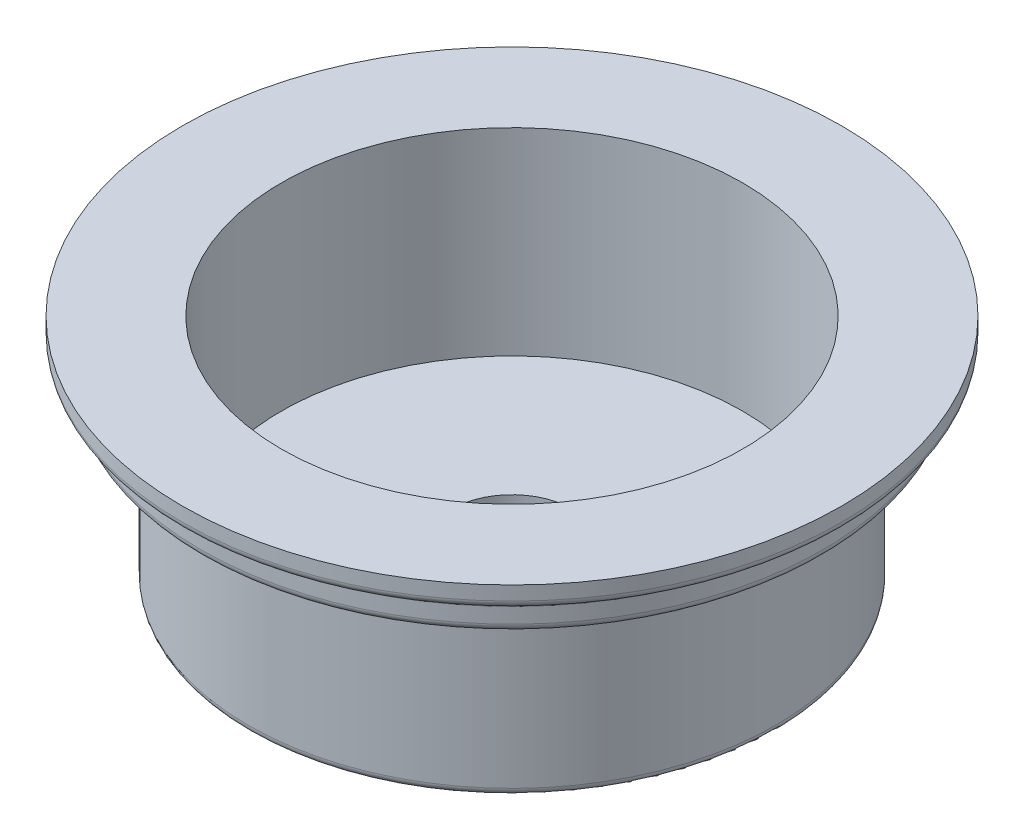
from build123d import *

# Parameters (mm, degrees)
FILLET1_R       = 1.524
SKETCH21_R      = 13.1445
NPT_DEPTH       = 14.05382
NPT_DRAFT       = -1.783333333
SKETCH31_R      = 11.6967
TAP_DRILL_DEPTH = 38.1


with BuildPart() as part:
    # Sketch1 → Base-Revolve (revolve)
    with BuildSketch(Plane.XY, mode=Mode.PRIVATE) as base_revolve_sk:
        Polygon((0, -38.1), (44.45, -38.1), (44.45, -3.16865), (44.45, 0), (54.7751, 0), (63.5, 0), (63.5, -3.7592), (59.9186, -5.062722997), (59.9186, -10.142722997), (50.8, -13.461621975), (50.8, -44.45), (44.45, -44.45), (19.05, -57.15), (0, -57.15), align=None)
    revolve(base_revolve_sk.sketch.rotate(Axis((0, 0, 0), (0, -1, 0)), 90), axis=Axis((0, 0, 0), (0, -1, 0)))

    # Fillet1
    fillet1_edges = [part.edges().sort_by_distance(p)[0] for p in [
        (0, -3.7592, -63.5),
        (0, -5.062722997, -59.9186),
        (0, -10.142722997, -59.9186),
        (0, -13.461621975, -50.8),
        (0, -44.45, -50.8),
        (0, -44.45, -44.45),
        (0, -57.15, -19.05),
    ]]
    fillet(fillet1_edges, radius=FILLET1_R)


with BuildPart() as npt_tool:
    # Sketch21 → NPT (with draft: the straight prism first)
    with BuildSketch(Plane(origin=(2.617351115, -57.15, 3.362535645), x_dir=(1, 0, 0), z_dir=(0, -1, 0))):
        with Locations((-2.617351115, -3.362535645)):
            Circle(SKETCH21_R)
    extrude(amount=-NPT_DEPTH)
    # NPT: the draft: its side faces are tilted about the plane it starts from
    npt_sides = [npt_tool.faces().sort_by_distance(p)[0] for p in [
        (-13.1445, -50.12309, 0),
    ]]
    draft(npt_sides, Plane(origin=(2.617351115, -57.15, 3.362535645), x_dir=(1, 0, 0), z_dir=(0, -1, 0)), NPT_DRAFT)


with BuildPart() as part_1:
    add(part.part)

    # NPT: cut by npt_tool
    add(npt_tool.part, mode=Mode.SUBTRACT)

    # Sketch31 → Tap Drill (cut)
    with BuildSketch(Plane(origin=(2.617351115, -57.15, 3.362535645), x_dir=(1, 0, 0), z_dir=(0, -1, 0))):
        with Locations(Location((-2.617351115, -3.362535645, 0), (0, 0, 270))):
            Circle(SKETCH31_R)
    extrude(amount=-TAP_DRILL_DEPTH, mode=Mode.SUBTRACT)


solid = part_1.part
